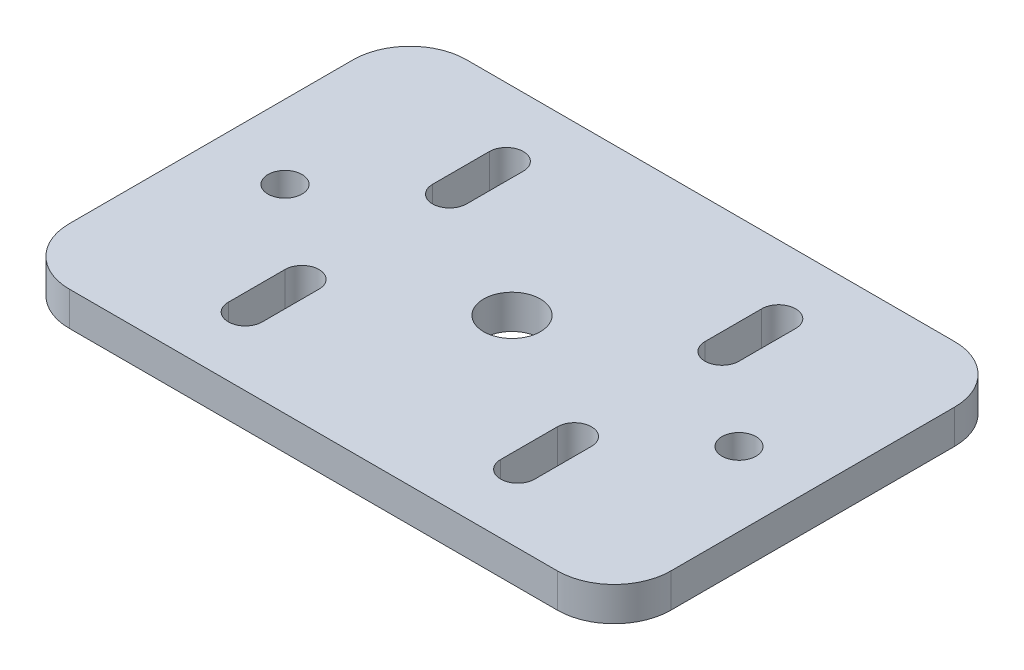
ISO-10303-21;
HEADER;
FILE_DESCRIPTION(('STEP AP214'),'2;1');
FILE_NAME('part.step','',(''),(''),'','','');
FILE_SCHEMA(('AUTOMOTIVE_DESIGN { 1 0 10303 214 1 1 1 1 }'));
ENDSEC;
DATA;
#1=APPLICATION_CONTEXT('core data for automotive mechanical design processes');
#2=APPLICATION_PROTOCOL_DEFINITION('international standard','automotive_design',2000,#1);
#3=PRODUCT_CONTEXT('',#1,'mechanical');
#4=PRODUCT('Part','Part','',(#3));
#5=PRODUCT_RELATED_PRODUCT_CATEGORY('part','',(#4));
#6=PRODUCT_DEFINITION_FORMATION('','',#4);
#7=PRODUCT_DEFINITION_CONTEXT('part definition',#1,'design');
#8=PRODUCT_DEFINITION('design','',#6,#7);
#9=PRODUCT_DEFINITION_SHAPE('','',#8);
#10=(LENGTH_UNIT() NAMED_UNIT(*) SI_UNIT(.MILLI.,.METRE.));
#11=(NAMED_UNIT(*) PLANE_ANGLE_UNIT() SI_UNIT($,.RADIAN.));
#12=(NAMED_UNIT(*) SI_UNIT($,.STERADIAN.) SOLID_ANGLE_UNIT());
#13=UNCERTAINTY_MEASURE_WITH_UNIT(LENGTH_MEASURE(1.E-05),#10,'distance_accuracy_value','');
#14=(GEOMETRIC_REPRESENTATION_CONTEXT(3) GLOBAL_UNCERTAINTY_ASSIGNED_CONTEXT((#13)) GLOBAL_UNIT_ASSIGNED_CONTEXT((#10,
#11,#12)) REPRESENTATION_CONTEXT('',''));
#15=CARTESIAN_POINT('',(0.,0.,0.));
#16=DIRECTION('',(0.,0.,1.));
#17=DIRECTION('',(1.,0.,0.));
#18=AXIS2_PLACEMENT_3D('',#15,#16,#17);
#19=CARTESIAN_POINT('',(0.,6.,-70.));
#20=DIRECTION('',(0.,-1.,0.));
#21=DIRECTION('',(0.,0.,-1.));
#22=AXIS2_PLACEMENT_3D('',#19,#20,#21);
#23=PLANE('',#22);
#24=CARTESIAN_POINT('',(29.,6.,-58.));
#25=DIRECTION('',(0.,1.,0.));
#26=DIRECTION('',(0.,0.,1.));
#27=AXIS2_PLACEMENT_3D('',#24,#25,#26);
#28=CIRCLE('',#27,3.00000000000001);
#29=CARTESIAN_POINT('',(32.,6.,-58.));
#30=VERTEX_POINT('',#29);
#31=CARTESIAN_POINT('',(26.,6.,-58.));
#32=VERTEX_POINT('',#31);
#33=EDGE_CURVE('E234',#30,#32,#28,.T.);
#34=ORIENTED_EDGE('',*,*,#33,.F.);
#35=DIRECTION('',(0.,0.,-1.));
#36=VECTOR('',#35,1.);
#37=CARTESIAN_POINT('',(32.,6.,-58.));
#38=LINE('',#37,#36);
#39=CARTESIAN_POINT('',(32.,6.,-48.));
#40=VERTEX_POINT('',#39);
#41=EDGE_CURVE('E242',#40,#30,#38,.T.);
#42=ORIENTED_EDGE('',*,*,#41,.F.);
#43=CARTESIAN_POINT('',(29.,6.,-48.));
#44=DIRECTION('',(0.,1.,0.));
#45=DIRECTION('',(0.,0.,1.));
#46=AXIS2_PLACEMENT_3D('',#43,#44,#45);
#47=CIRCLE('',#46,3.);
#48=CARTESIAN_POINT('',(26.,6.,-48.));
#49=VERTEX_POINT('',#48);
#50=EDGE_CURVE('E239',#49,#40,#47,.T.);
#51=ORIENTED_EDGE('',*,*,#50,.F.);
#52=DIRECTION('',(0.,0.,1.));
#53=VECTOR('',#52,1.);
#54=CARTESIAN_POINT('',(26.,6.,-58.));
#55=LINE('',#54,#53);
#56=EDGE_CURVE('E236',#32,#49,#55,.T.);
#57=ORIENTED_EDGE('',*,*,#56,.F.);
#58=EDGE_LOOP('',(#34,#42,#51,#57));
#59=FACE_BOUND('',#58,.T.);
#60=CARTESIAN_POINT('',(77.,6.,-58.));
#61=DIRECTION('',(0.,1.,0.));
#62=DIRECTION('',(0.,0.,1.));
#63=AXIS2_PLACEMENT_3D('',#60,#61,#62);
#64=CIRCLE('',#63,3.00000000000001);
#65=CARTESIAN_POINT('',(80.,6.,-58.));
#66=VERTEX_POINT('',#65);
#67=CARTESIAN_POINT('',(74.,6.,-58.));
#68=VERTEX_POINT('',#67);
#69=EDGE_CURVE('E296',#66,#68,#64,.T.);
#70=ORIENTED_EDGE('',*,*,#69,.F.);
#71=DIRECTION('',(0.,0.,-1.));
#72=VECTOR('',#71,1.);
#73=CARTESIAN_POINT('',(80.,6.,-58.));
#74=LINE('',#73,#72);
#75=CARTESIAN_POINT('',(80.,6.,-48.));
#76=VERTEX_POINT('',#75);
#77=EDGE_CURVE('E304',#76,#66,#74,.T.);
#78=ORIENTED_EDGE('',*,*,#77,.F.);
#79=CARTESIAN_POINT('',(77.,6.,-48.));
#80=DIRECTION('',(0.,1.,0.));
#81=DIRECTION('',(0.,0.,1.));
#82=AXIS2_PLACEMENT_3D('',#79,#80,#81);
#83=CIRCLE('',#82,3.);
#84=CARTESIAN_POINT('',(74.,6.,-48.));
#85=VERTEX_POINT('',#84);
#86=EDGE_CURVE('E301',#85,#76,#83,.T.);
#87=ORIENTED_EDGE('',*,*,#86,.F.);
#88=DIRECTION('',(0.,0.,1.));
#89=VECTOR('',#88,1.);
#90=CARTESIAN_POINT('',(74.,6.,-58.));
#91=LINE('',#90,#89);
#92=EDGE_CURVE('E298',#68,#85,#91,.T.);
#93=ORIENTED_EDGE('',*,*,#92,.F.);
#94=EDGE_LOOP('',(#70,#78,#87,#93));
#95=FACE_BOUND('',#94,.T.);
#96=CARTESIAN_POINT('',(13.,6.,-35.));
#97=DIRECTION('',(0.,1.,0.));
#98=DIRECTION('',(0.,0.,1.));
#99=AXIS2_PLACEMENT_3D('',#96,#97,#98);
#100=CIRCLE('',#99,3.);
#101=CARTESIAN_POINT('',(13.,6.,-32.));
#102=VERTEX_POINT('',#101);
#103=EDGE_CURVE('E333',#102,#102,#100,.T.);
#104=ORIENTED_EDGE('',*,*,#103,.F.);
#105=EDGE_LOOP('',(#104));
#106=FACE_BOUND('',#105,.T.);
#107=DIRECTION('',(-1.,0.,0.));
#108=VECTOR('',#107,1.);
#109=CARTESIAN_POINT('',(0.,6.,-70.));
#110=LINE('',#109,#108);
#111=CARTESIAN_POINT('',(96.,6.,-70.));
#112=VERTEX_POINT('',#111);
#113=CARTESIAN_POINT('',(10.,6.,-70.));
#114=VERTEX_POINT('',#113);
#115=EDGE_CURVE('E353',#112,#114,#110,.T.);
#116=ORIENTED_EDGE('',*,*,#115,.T.);
#117=CARTESIAN_POINT('',(10.,6.,-60.));
#118=DIRECTION('',(0.,-1.,0.));
#119=DIRECTION('',(0.,0.,-1.));
#120=AXIS2_PLACEMENT_3D('',#117,#118,#119);
#121=CIRCLE('',#120,10.);
#122=CARTESIAN_POINT('',(0.,6.,-60.));
#123=VERTEX_POINT('',#122);
#124=EDGE_CURVE('E388',#114,#123,#121,.F.);
#125=ORIENTED_EDGE('',*,*,#124,.T.);
#126=DIRECTION('',(0.,0.,1.));
#127=VECTOR('',#126,1.);
#128=CARTESIAN_POINT('',(0.,6.,0.));
#129=LINE('',#128,#127);
#130=CARTESIAN_POINT('',(0.,6.,-10.));
#131=VERTEX_POINT('',#130);
#132=EDGE_CURVE('E345',#123,#131,#129,.T.);
#133=ORIENTED_EDGE('',*,*,#132,.T.);
#134=CARTESIAN_POINT('',(10.,6.,-10.));
#135=DIRECTION('',(0.,-1.,0.));
#136=DIRECTION('',(0.,0.,-1.));
#137=AXIS2_PLACEMENT_3D('',#134,#135,#136);
#138=CIRCLE('',#137,10.);
#139=CARTESIAN_POINT('',(10.,6.,0.));
#140=VERTEX_POINT('',#139);
#141=EDGE_CURVE('E383',#131,#140,#138,.F.);
#142=ORIENTED_EDGE('',*,*,#141,.T.);
#143=DIRECTION('',(1.,0.,0.));
#144=VECTOR('',#143,1.);
#145=CARTESIAN_POINT('',(0.,6.,0.));
#146=LINE('',#145,#144);
#147=CARTESIAN_POINT('',(96.,6.,0.));
#148=VERTEX_POINT('',#147);
#149=EDGE_CURVE('E348',#140,#148,#146,.T.);
#150=ORIENTED_EDGE('',*,*,#149,.T.);
#151=CARTESIAN_POINT('',(96.,6.,-10.));
#152=DIRECTION('',(0.,-1.,0.));
#153=DIRECTION('',(0.,0.,-1.));
#154=AXIS2_PLACEMENT_3D('',#151,#152,#153);
#155=CIRCLE('',#154,10.);
#156=CARTESIAN_POINT('',(106.,6.,-10.));
#157=VERTEX_POINT('',#156);
#158=EDGE_CURVE('E52',#148,#157,#155,.F.);
#159=ORIENTED_EDGE('',*,*,#158,.T.);
#160=DIRECTION('',(0.,0.,-1.));
#161=VECTOR('',#160,1.);
#162=CARTESIAN_POINT('',(106.,6.,0.));
#163=LINE('',#162,#161);
#164=CARTESIAN_POINT('',(106.,6.,-60.));
#165=VERTEX_POINT('',#164);
#166=EDGE_CURVE('E351',#157,#165,#163,.T.);
#167=ORIENTED_EDGE('',*,*,#166,.T.);
#168=CARTESIAN_POINT('',(96.,6.,-60.));
#169=DIRECTION('',(0.,-1.,0.));
#170=DIRECTION('',(0.,0.,-1.));
#171=AXIS2_PLACEMENT_3D('',#168,#169,#170);
#172=CIRCLE('',#171,10.);
#173=EDGE_CURVE('E386',#165,#112,#172,.F.);
#174=ORIENTED_EDGE('',*,*,#173,.T.);
#175=EDGE_LOOP('',(#116,#125,#133,#142,#150,#159,#167,#174));
#176=FACE_BOUND('',#175,.T.);
#177=CARTESIAN_POINT('',(53.,6.,-35.));
#178=DIRECTION('',(0.,1.,0.));
#179=DIRECTION('',(0.,0.,1.));
#180=AXIS2_PLACEMENT_3D('',#177,#178,#179);
#181=CIRCLE('',#180,5.);
#182=CARTESIAN_POINT('',(53.,6.,-30.));
#183=VERTEX_POINT('',#182);
#184=EDGE_CURVE('E339',#183,#183,#181,.T.);
#185=ORIENTED_EDGE('',*,*,#184,.F.);
#186=EDGE_LOOP('',(#185));
#187=FACE_BOUND('',#186,.T.);
#188=CARTESIAN_POINT('',(93.,6.,-35.));
#189=DIRECTION('',(0.,1.,0.));
#190=DIRECTION('',(0.,0.,1.));
#191=AXIS2_PLACEMENT_3D('',#188,#189,#190);
#192=CIRCLE('',#191,3.00000000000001);
#193=CARTESIAN_POINT('',(93.,6.,-32.));
#194=VERTEX_POINT('',#193);
#195=EDGE_CURVE('E327',#194,#194,#192,.T.);
#196=ORIENTED_EDGE('',*,*,#195,.F.);
#197=EDGE_LOOP('',(#196));
#198=FACE_BOUND('',#197,.T.);
#199=CARTESIAN_POINT('',(29.0000000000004,6.,-22.));
#200=DIRECTION('',(0.,1.,0.));
#201=DIRECTION('',(0.,0.,1.));
#202=AXIS2_PLACEMENT_3D('',#199,#200,#201);
#203=CIRCLE('',#202,3.);
#204=CARTESIAN_POINT('',(32.0000000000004,6.,-22.));
#205=VERTEX_POINT('',#204);
#206=CARTESIAN_POINT('',(26.0000000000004,6.,-22.));
#207=VERTEX_POINT('',#206);
#208=EDGE_CURVE('E265',#205,#207,#203,.T.);
#209=ORIENTED_EDGE('',*,*,#208,.F.);
#210=DIRECTION('',(0.,0.,-1.));
#211=VECTOR('',#210,1.);
#212=CARTESIAN_POINT('',(32.0000000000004,6.,-22.));
#213=LINE('',#212,#211);
#214=CARTESIAN_POINT('',(32.0000000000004,6.,-12.));
#215=VERTEX_POINT('',#214);
#216=EDGE_CURVE('E273',#215,#205,#213,.T.);
#217=ORIENTED_EDGE('',*,*,#216,.F.);
#218=CARTESIAN_POINT('',(29.0000000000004,6.,-12.));
#219=DIRECTION('',(0.,1.,0.));
#220=DIRECTION('',(0.,0.,1.));
#221=AXIS2_PLACEMENT_3D('',#218,#219,#220);
#222=CIRCLE('',#221,3.);
#223=CARTESIAN_POINT('',(26.0000000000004,6.,-12.));
#224=VERTEX_POINT('',#223);
#225=EDGE_CURVE('E270',#224,#215,#222,.T.);
#226=ORIENTED_EDGE('',*,*,#225,.F.);
#227=DIRECTION('',(0.,0.,1.));
#228=VECTOR('',#227,1.);
#229=CARTESIAN_POINT('',(26.0000000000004,6.,-22.));
#230=LINE('',#229,#228);
#231=EDGE_CURVE('E267',#207,#224,#230,.T.);
#232=ORIENTED_EDGE('',*,*,#231,.F.);
#233=EDGE_LOOP('',(#209,#217,#226,#232));
#234=FACE_BOUND('',#233,.T.);
#235=CARTESIAN_POINT('',(77.0000000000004,6.,-22.));
#236=DIRECTION('',(0.,1.,0.));
#237=DIRECTION('',(0.,0.,1.));
#238=AXIS2_PLACEMENT_3D('',#235,#236,#237);
#239=CIRCLE('',#238,3.);
#240=CARTESIAN_POINT('',(80.0000000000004,6.,-22.));
#241=VERTEX_POINT('',#240);
#242=CARTESIAN_POINT('',(74.0000000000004,6.,-22.));
#243=VERTEX_POINT('',#242);
#244=EDGE_CURVE('E193',#241,#243,#239,.T.);
#245=ORIENTED_EDGE('',*,*,#244,.F.);
#246=DIRECTION('',(0.,0.,-1.));
#247=VECTOR('',#246,1.);
#248=CARTESIAN_POINT('',(80.0000000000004,6.,-22.));
#249=LINE('',#248,#247);
#250=CARTESIAN_POINT('',(80.0000000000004,6.,-12.));
#251=VERTEX_POINT('',#250);
#252=EDGE_CURVE('E218',#251,#241,#249,.T.);
#253=ORIENTED_EDGE('',*,*,#252,.F.);
#254=CARTESIAN_POINT('',(77.0000000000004,6.,-12.));
#255=DIRECTION('',(0.,1.,0.));
#256=DIRECTION('',(0.,0.,1.));
#257=AXIS2_PLACEMENT_3D('',#254,#255,#256);
#258=CIRCLE('',#257,3.);
#259=CARTESIAN_POINT('',(74.0000000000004,6.,-12.));
#260=VERTEX_POINT('',#259);
#261=EDGE_CURVE('E216',#260,#251,#258,.T.);
#262=ORIENTED_EDGE('',*,*,#261,.F.);
#263=DIRECTION('',(0.,0.,1.));
#264=VECTOR('',#263,1.);
#265=CARTESIAN_POINT('',(74.0000000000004,6.,-22.));
#266=LINE('',#265,#264);
#267=EDGE_CURVE('E203',#243,#260,#266,.T.);
#268=ORIENTED_EDGE('',*,*,#267,.F.);
#269=EDGE_LOOP('',(#245,#253,#262,#268));
#270=FACE_BOUND('',#269,.T.);
#271=ADVANCED_FACE('F30',(#59,#95,#106,#176,#187,#198,#234,#270),#23,.F.);
#272=CARTESIAN_POINT('',(0.,0.,-70.));
#273=DIRECTION('',(0.,-1.,0.));
#274=DIRECTION('',(0.,0.,-1.));
#275=AXIS2_PLACEMENT_3D('',#272,#273,#274);
#276=PLANE('',#275);
#277=DIRECTION('',(0.,0.,-1.));
#278=VECTOR('',#277,1.);
#279=CARTESIAN_POINT('',(32.,0.,-58.));
#280=LINE('',#279,#278);
#281=CARTESIAN_POINT('',(32.,0.,-48.));
#282=VERTEX_POINT('',#281);
#283=CARTESIAN_POINT('',(32.,0.,-58.));
#284=VERTEX_POINT('',#283);
#285=EDGE_CURVE('E237',#282,#284,#280,.T.);
#286=ORIENTED_EDGE('',*,*,#285,.T.);
#287=CARTESIAN_POINT('',(29.,0.,-58.));
#288=DIRECTION('',(0.,1.,0.));
#289=DIRECTION('',(0.,0.,1.));
#290=AXIS2_PLACEMENT_3D('',#287,#288,#289);
#291=CIRCLE('',#290,3.00000000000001);
#292=CARTESIAN_POINT('',(26.,0.,-58.));
#293=VERTEX_POINT('',#292);
#294=EDGE_CURVE('E211',#284,#293,#291,.T.);
#295=ORIENTED_EDGE('',*,*,#294,.T.);
#296=DIRECTION('',(0.,0.,1.));
#297=VECTOR('',#296,1.);
#298=CARTESIAN_POINT('',(26.,0.,-58.));
#299=LINE('',#298,#297);
#300=CARTESIAN_POINT('',(26.,0.,-48.));
#301=VERTEX_POINT('',#300);
#302=EDGE_CURVE('E247',#293,#301,#299,.T.);
#303=ORIENTED_EDGE('',*,*,#302,.T.);
#304=CARTESIAN_POINT('',(29.,0.,-48.));
#305=DIRECTION('',(0.,1.,0.));
#306=DIRECTION('',(0.,0.,1.));
#307=AXIS2_PLACEMENT_3D('',#304,#305,#306);
#308=CIRCLE('',#307,3.);
#309=EDGE_CURVE('E250',#301,#282,#308,.T.);
#310=ORIENTED_EDGE('',*,*,#309,.T.);
#311=EDGE_LOOP('',(#286,#295,#303,#310));
#312=FACE_BOUND('',#311,.T.);
#313=DIRECTION('',(0.,0.,-1.));
#314=VECTOR('',#313,1.);
#315=CARTESIAN_POINT('',(80.,0.,-58.));
#316=LINE('',#315,#314);
#317=CARTESIAN_POINT('',(80.,0.,-48.));
#318=VERTEX_POINT('',#317);
#319=CARTESIAN_POINT('',(80.,0.,-58.));
#320=VERTEX_POINT('',#319);
#321=EDGE_CURVE('E299',#318,#320,#316,.T.);
#322=ORIENTED_EDGE('',*,*,#321,.T.);
#323=CARTESIAN_POINT('',(77.,0.,-58.));
#324=DIRECTION('',(0.,1.,0.));
#325=DIRECTION('',(0.,0.,1.));
#326=AXIS2_PLACEMENT_3D('',#323,#324,#325);
#327=CIRCLE('',#326,3.00000000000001);
#328=CARTESIAN_POINT('',(74.,0.,-58.));
#329=VERTEX_POINT('',#328);
#330=EDGE_CURVE('E295',#320,#329,#327,.T.);
#331=ORIENTED_EDGE('',*,*,#330,.T.);
#332=DIRECTION('',(0.,0.,1.));
#333=VECTOR('',#332,1.);
#334=CARTESIAN_POINT('',(74.,0.,-58.));
#335=LINE('',#334,#333);
#336=CARTESIAN_POINT('',(74.,0.,-48.));
#337=VERTEX_POINT('',#336);
#338=EDGE_CURVE('E309',#329,#337,#335,.T.);
#339=ORIENTED_EDGE('',*,*,#338,.T.);
#340=CARTESIAN_POINT('',(77.,0.,-48.));
#341=DIRECTION('',(0.,1.,0.));
#342=DIRECTION('',(0.,0.,1.));
#343=AXIS2_PLACEMENT_3D('',#340,#341,#342);
#344=CIRCLE('',#343,3.);
#345=EDGE_CURVE('E312',#337,#318,#344,.T.);
#346=ORIENTED_EDGE('',*,*,#345,.T.);
#347=EDGE_LOOP('',(#322,#331,#339,#346));
#348=FACE_BOUND('',#347,.T.);
#349=CARTESIAN_POINT('',(13.,0.,-35.));
#350=DIRECTION('',(0.,1.,0.));
#351=DIRECTION('',(0.,0.,1.));
#352=AXIS2_PLACEMENT_3D('',#349,#350,#351);
#353=CIRCLE('',#352,3.);
#354=CARTESIAN_POINT('',(13.,0.,-32.));
#355=VERTEX_POINT('',#354);
#356=EDGE_CURVE('E330',#355,#355,#353,.T.);
#357=ORIENTED_EDGE('',*,*,#356,.T.);
#358=EDGE_LOOP('',(#357));
#359=FACE_BOUND('',#358,.T.);
#360=DIRECTION('',(0.,0.,1.));
#361=VECTOR('',#360,1.);
#362=CARTESIAN_POINT('',(0.,0.,0.));
#363=LINE('',#362,#361);
#364=CARTESIAN_POINT('',(0.,0.,-60.));
#365=VERTEX_POINT('',#364);
#366=CARTESIAN_POINT('',(0.,0.,-10.));
#367=VERTEX_POINT('',#366);
#368=EDGE_CURVE('E342',#365,#367,#363,.T.);
#369=ORIENTED_EDGE('',*,*,#368,.F.);
#370=CARTESIAN_POINT('',(10.,0.,-60.));
#371=DIRECTION('',(0.,-1.,0.));
#372=DIRECTION('',(0.,0.,-1.));
#373=AXIS2_PLACEMENT_3D('',#370,#371,#372);
#374=CIRCLE('',#373,10.);
#375=CARTESIAN_POINT('',(10.,0.,-70.));
#376=VERTEX_POINT('',#375);
#377=EDGE_CURVE('E376',#365,#376,#374,.T.);
#378=ORIENTED_EDGE('',*,*,#377,.T.);
#379=DIRECTION('',(-1.,0.,0.));
#380=VECTOR('',#379,1.);
#381=CARTESIAN_POINT('',(0.,0.,-70.));
#382=LINE('',#381,#380);
#383=CARTESIAN_POINT('',(96.,0.,-70.));
#384=VERTEX_POINT('',#383);
#385=EDGE_CURVE('E349',#384,#376,#382,.T.);
#386=ORIENTED_EDGE('',*,*,#385,.F.);
#387=CARTESIAN_POINT('',(96.,0.,-60.));
#388=DIRECTION('',(0.,-1.,0.));
#389=DIRECTION('',(0.,0.,-1.));
#390=AXIS2_PLACEMENT_3D('',#387,#388,#389);
#391=CIRCLE('',#390,10.);
#392=CARTESIAN_POINT('',(106.,0.,-60.));
#393=VERTEX_POINT('',#392);
#394=EDGE_CURVE('E374',#384,#393,#391,.T.);
#395=ORIENTED_EDGE('',*,*,#394,.T.);
#396=DIRECTION('',(0.,0.,-1.));
#397=VECTOR('',#396,1.);
#398=CARTESIAN_POINT('',(106.,0.,0.));
#399=LINE('',#398,#397);
#400=CARTESIAN_POINT('',(106.,0.,-10.));
#401=VERTEX_POINT('',#400);
#402=EDGE_CURVE('E362',#401,#393,#399,.T.);
#403=ORIENTED_EDGE('',*,*,#402,.F.);
#404=CARTESIAN_POINT('',(96.,0.,-10.));
#405=DIRECTION('',(0.,-1.,0.));
#406=DIRECTION('',(0.,0.,-1.));
#407=AXIS2_PLACEMENT_3D('',#404,#405,#406);
#408=CIRCLE('',#407,10.);
#409=CARTESIAN_POINT('',(96.,0.,0.));
#410=VERTEX_POINT('',#409);
#411=EDGE_CURVE('E372',#401,#410,#408,.T.);
#412=ORIENTED_EDGE('',*,*,#411,.T.);
#413=DIRECTION('',(1.,0.,0.));
#414=VECTOR('',#413,1.);
#415=CARTESIAN_POINT('',(0.,0.,0.));
#416=LINE('',#415,#414);
#417=CARTESIAN_POINT('',(10.,0.,0.));
#418=VERTEX_POINT('',#417);
#419=EDGE_CURVE('E359',#418,#410,#416,.T.);
#420=ORIENTED_EDGE('',*,*,#419,.F.);
#421=CARTESIAN_POINT('',(10.,0.,-10.));
#422=DIRECTION('',(0.,-1.,0.));
#423=DIRECTION('',(0.,0.,-1.));
#424=AXIS2_PLACEMENT_3D('',#421,#422,#423);
#425=CIRCLE('',#424,10.);
#426=EDGE_CURVE('E370',#418,#367,#425,.T.);
#427=ORIENTED_EDGE('',*,*,#426,.T.);
#428=EDGE_LOOP('',(#369,#378,#386,#395,#403,#412,#420,#427));
#429=FACE_BOUND('',#428,.T.);
#430=CARTESIAN_POINT('',(53.,0.,-35.));
#431=DIRECTION('',(0.,1.,0.));
#432=DIRECTION('',(0.,0.,1.));
#433=AXIS2_PLACEMENT_3D('',#430,#431,#432);
#434=CIRCLE('',#433,5.);
#435=CARTESIAN_POINT('',(53.,0.,-30.));
#436=VERTEX_POINT('',#435);
#437=EDGE_CURVE('E336',#436,#436,#434,.T.);
#438=ORIENTED_EDGE('',*,*,#437,.T.);
#439=EDGE_LOOP('',(#438));
#440=FACE_BOUND('',#439,.T.);
#441=CARTESIAN_POINT('',(93.,0.,-35.));
#442=DIRECTION('',(0.,1.,0.));
#443=DIRECTION('',(0.,0.,1.));
#444=AXIS2_PLACEMENT_3D('',#441,#442,#443);
#445=CIRCLE('',#444,3.00000000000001);
#446=CARTESIAN_POINT('',(93.,0.,-32.));
#447=VERTEX_POINT('',#446);
#448=EDGE_CURVE('E326',#447,#447,#445,.T.);
#449=ORIENTED_EDGE('',*,*,#448,.T.);
#450=EDGE_LOOP('',(#449));
#451=FACE_BOUND('',#450,.T.);
#452=DIRECTION('',(0.,0.,-1.));
#453=VECTOR('',#452,1.);
#454=CARTESIAN_POINT('',(32.0000000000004,0.,-22.));
#455=LINE('',#454,#453);
#456=CARTESIAN_POINT('',(32.0000000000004,0.,-12.));
#457=VERTEX_POINT('',#456);
#458=CARTESIAN_POINT('',(32.0000000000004,0.,-22.));
#459=VERTEX_POINT('',#458);
#460=EDGE_CURVE('E268',#457,#459,#455,.T.);
#461=ORIENTED_EDGE('',*,*,#460,.T.);
#462=CARTESIAN_POINT('',(29.0000000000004,0.,-22.));
#463=DIRECTION('',(0.,1.,0.));
#464=DIRECTION('',(0.,0.,1.));
#465=AXIS2_PLACEMENT_3D('',#462,#463,#464);
#466=CIRCLE('',#465,3.);
#467=CARTESIAN_POINT('',(26.0000000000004,0.,-22.));
#468=VERTEX_POINT('',#467);
#469=EDGE_CURVE('E264',#459,#468,#466,.T.);
#470=ORIENTED_EDGE('',*,*,#469,.T.);
#471=DIRECTION('',(0.,0.,1.));
#472=VECTOR('',#471,1.);
#473=CARTESIAN_POINT('',(26.0000000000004,0.,-22.));
#474=LINE('',#473,#472);
#475=CARTESIAN_POINT('',(26.0000000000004,0.,-12.));
#476=VERTEX_POINT('',#475);
#477=EDGE_CURVE('E278',#468,#476,#474,.T.);
#478=ORIENTED_EDGE('',*,*,#477,.T.);
#479=CARTESIAN_POINT('',(29.0000000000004,0.,-12.));
#480=DIRECTION('',(0.,1.,0.));
#481=DIRECTION('',(0.,0.,1.));
#482=AXIS2_PLACEMENT_3D('',#479,#480,#481);
#483=CIRCLE('',#482,3.);
#484=EDGE_CURVE('E281',#476,#457,#483,.T.);
#485=ORIENTED_EDGE('',*,*,#484,.T.);
#486=EDGE_LOOP('',(#461,#470,#478,#485));
#487=FACE_BOUND('',#486,.T.);
#488=DIRECTION('',(0.,0.,-1.));
#489=VECTOR('',#488,1.);
#490=CARTESIAN_POINT('',(80.0000000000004,0.,-22.));
#491=LINE('',#490,#489);
#492=CARTESIAN_POINT('',(80.0000000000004,0.,-12.));
#493=VERTEX_POINT('',#492);
#494=CARTESIAN_POINT('',(80.0000000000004,0.,-22.));
#495=VERTEX_POINT('',#494);
#496=EDGE_CURVE('E204',#493,#495,#491,.T.);
#497=ORIENTED_EDGE('',*,*,#496,.T.);
#498=CARTESIAN_POINT('',(77.0000000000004,0.,-22.));
#499=DIRECTION('',(0.,1.,0.));
#500=DIRECTION('',(0.,0.,1.));
#501=AXIS2_PLACEMENT_3D('',#498,#499,#500);
#502=CIRCLE('',#501,3.);
#503=CARTESIAN_POINT('',(74.0000000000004,0.,-22.));
#504=VERTEX_POINT('',#503);
#505=EDGE_CURVE('E222',#495,#504,#502,.T.);
#506=ORIENTED_EDGE('',*,*,#505,.T.);
#507=DIRECTION('',(0.,0.,1.));
#508=VECTOR('',#507,1.);
#509=CARTESIAN_POINT('',(74.0000000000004,0.,-22.));
#510=LINE('',#509,#508);
#511=CARTESIAN_POINT('',(74.0000000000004,0.,-12.));
#512=VERTEX_POINT('',#511);
#513=EDGE_CURVE('E210',#504,#512,#510,.T.);
#514=ORIENTED_EDGE('',*,*,#513,.T.);
#515=CARTESIAN_POINT('',(77.0000000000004,0.,-12.));
#516=DIRECTION('',(0.,1.,0.));
#517=DIRECTION('',(0.,0.,1.));
#518=AXIS2_PLACEMENT_3D('',#515,#516,#517);
#519=CIRCLE('',#518,3.);
#520=EDGE_CURVE('E225',#512,#493,#519,.T.);
#521=ORIENTED_EDGE('',*,*,#520,.T.);
#522=EDGE_LOOP('',(#497,#506,#514,#521));
#523=FACE_BOUND('',#522,.T.);
#524=ADVANCED_FACE('F404',(#312,#348,#359,#429,#440,#451,#487,#523),#276,.T.);
#525=CARTESIAN_POINT('',(0.,6.,0.));
#526=DIRECTION('',(1.,0.,0.));
#527=DIRECTION('',(0.,0.,-1.));
#528=AXIS2_PLACEMENT_3D('',#525,#526,#527);
#529=PLANE('',#528);
#530=ORIENTED_EDGE('',*,*,#132,.F.);
#531=DIRECTION('',(0.,-1.,0.));
#532=VECTOR('',#531,1.);
#533=CARTESIAN_POINT('',(0.,6.,-60.));
#534=LINE('',#533,#532);
#535=EDGE_CURVE('E367',#123,#365,#534,.T.);
#536=ORIENTED_EDGE('',*,*,#535,.T.);
#537=ORIENTED_EDGE('',*,*,#368,.T.);
#538=DIRECTION('',(0.,-1.,0.));
#539=VECTOR('',#538,1.);
#540=CARTESIAN_POINT('',(0.,6.,-10.));
#541=LINE('',#540,#539);
#542=EDGE_CURVE('E356',#367,#131,#541,.F.);
#543=ORIENTED_EDGE('',*,*,#542,.T.);
#544=EDGE_LOOP('',(#530,#536,#537,#543));
#545=FACE_BOUND('',#544,.T.);
#546=ADVANCED_FACE('F427',(#545),#529,.F.);
#547=CARTESIAN_POINT('',(0.,6.,0.));
#548=DIRECTION('',(0.,0.,-1.));
#549=DIRECTION('',(-1.,0.,0.));
#550=AXIS2_PLACEMENT_3D('',#547,#548,#549);
#551=PLANE('',#550);
#552=ORIENTED_EDGE('',*,*,#419,.T.);
#553=DIRECTION('',(0.,-1.,0.));
#554=VECTOR('',#553,1.);
#555=CARTESIAN_POINT('',(96.,6.,0.));
#556=LINE('',#555,#554);
#557=EDGE_CURVE('E11',#410,#148,#556,.F.);
#558=ORIENTED_EDGE('',*,*,#557,.T.);
#559=ORIENTED_EDGE('',*,*,#149,.F.);
#560=DIRECTION('',(0.,-1.,0.));
#561=VECTOR('',#560,1.);
#562=CARTESIAN_POINT('',(10.,6.,0.));
#563=LINE('',#562,#561);
#564=EDGE_CURVE('E38',#140,#418,#563,.T.);
#565=ORIENTED_EDGE('',*,*,#564,.T.);
#566=EDGE_LOOP('',(#552,#558,#559,#565));
#567=FACE_BOUND('',#566,.T.);
#568=ADVANCED_FACE('F398',(#567),#551,.F.);
#569=CARTESIAN_POINT('',(106.,6.,0.));
#570=DIRECTION('',(-1.,0.,0.));
#571=DIRECTION('',(0.,0.,1.));
#572=AXIS2_PLACEMENT_3D('',#569,#570,#571);
#573=PLANE('',#572);
#574=ORIENTED_EDGE('',*,*,#402,.T.);
#575=DIRECTION('',(0.,-1.,0.));
#576=VECTOR('',#575,1.);
#577=CARTESIAN_POINT('',(106.,6.,-60.));
#578=LINE('',#577,#576);
#579=EDGE_CURVE('E45',#393,#165,#578,.F.);
#580=ORIENTED_EDGE('',*,*,#579,.T.);
#581=ORIENTED_EDGE('',*,*,#166,.F.);
#582=DIRECTION('',(0.,-1.,0.));
#583=VECTOR('',#582,1.);
#584=CARTESIAN_POINT('',(106.,6.,-10.));
#585=LINE('',#584,#583);
#586=EDGE_CURVE('E390',#157,#401,#585,.T.);
#587=ORIENTED_EDGE('',*,*,#586,.T.);
#588=EDGE_LOOP('',(#574,#580,#581,#587));
#589=FACE_BOUND('',#588,.T.);
#590=ADVANCED_FACE('F410',(#589),#573,.F.);
#591=CARTESIAN_POINT('',(0.,6.,-70.));
#592=DIRECTION('',(0.,0.,1.));
#593=DIRECTION('',(1.,0.,0.));
#594=AXIS2_PLACEMENT_3D('',#591,#592,#593);
#595=PLANE('',#594);
#596=ORIENTED_EDGE('',*,*,#385,.T.);
#597=DIRECTION('',(0.,-1.,0.));
#598=VECTOR('',#597,1.);
#599=CARTESIAN_POINT('',(10.,6.,-70.));
#600=LINE('',#599,#598);
#601=EDGE_CURVE('E381',#376,#114,#600,.F.);
#602=ORIENTED_EDGE('',*,*,#601,.T.);
#603=ORIENTED_EDGE('',*,*,#115,.F.);
#604=DIRECTION('',(0.,-1.,0.));
#605=VECTOR('',#604,1.);
#606=CARTESIAN_POINT('',(96.,6.,-70.));
#607=LINE('',#606,#605);
#608=EDGE_CURVE('E378',#112,#384,#607,.T.);
#609=ORIENTED_EDGE('',*,*,#608,.T.);
#610=EDGE_LOOP('',(#596,#602,#603,#609));
#611=FACE_BOUND('',#610,.T.);
#612=ADVANCED_FACE('F419',(#611),#595,.F.);
#613=CARTESIAN_POINT('',(53.,6.,-35.));
#614=DIRECTION('',(0.,-1.,0.));
#615=DIRECTION('',(0.,0.,-1.));
#616=AXIS2_PLACEMENT_3D('',#613,#614,#615);
#617=CYLINDRICAL_SURFACE('',#616,5.);
#618=ORIENTED_EDGE('',*,*,#184,.T.);
#619=EDGE_LOOP('',(#618));
#620=FACE_BOUND('',#619,.T.);
#621=ORIENTED_EDGE('',*,*,#437,.F.);
#622=EDGE_LOOP('',(#621));
#623=FACE_BOUND('',#622,.T.);
#624=ADVANCED_FACE('F444',(#620,#623),#617,.F.);
#625=CARTESIAN_POINT('',(13.,6.,-35.));
#626=DIRECTION('',(0.,-1.,0.));
#627=DIRECTION('',(0.,0.,-1.));
#628=AXIS2_PLACEMENT_3D('',#625,#626,#627);
#629=CYLINDRICAL_SURFACE('',#628,3.);
#630=ORIENTED_EDGE('',*,*,#103,.T.);
#631=EDGE_LOOP('',(#630));
#632=FACE_BOUND('',#631,.T.);
#633=ORIENTED_EDGE('',*,*,#356,.F.);
#634=EDGE_LOOP('',(#633));
#635=FACE_BOUND('',#634,.T.);
#636=ADVANCED_FACE('F628',(#632,#635),#629,.F.);
#637=CARTESIAN_POINT('',(93.,6.,-35.));
#638=DIRECTION('',(0.,-1.,0.));
#639=DIRECTION('',(0.,0.,-1.));
#640=AXIS2_PLACEMENT_3D('',#637,#638,#639);
#641=CYLINDRICAL_SURFACE('',#640,3.00000000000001);
#642=ORIENTED_EDGE('',*,*,#195,.T.);
#643=EDGE_LOOP('',(#642));
#644=FACE_BOUND('',#643,.T.);
#645=ORIENTED_EDGE('',*,*,#448,.F.);
#646=EDGE_LOOP('',(#645));
#647=FACE_BOUND('',#646,.T.);
#648=ADVANCED_FACE('F619',(#644,#647),#641,.F.);
#649=CARTESIAN_POINT('',(77.,6.,-58.));
#650=DIRECTION('',(0.,-1.,0.));
#651=DIRECTION('',(0.,0.,-1.));
#652=AXIS2_PLACEMENT_3D('',#649,#650,#651);
#653=CYLINDRICAL_SURFACE('',#652,3.00000000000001);
#654=ORIENTED_EDGE('',*,*,#330,.F.);
#655=DIRECTION('',(0.,-1.,0.));
#656=VECTOR('',#655,1.);
#657=CARTESIAN_POINT('',(80.,6.,-58.));
#658=LINE('',#657,#656);
#659=EDGE_CURVE('E306',#66,#320,#658,.T.);
#660=ORIENTED_EDGE('',*,*,#659,.F.);
#661=ORIENTED_EDGE('',*,*,#69,.T.);
#662=DIRECTION('',(0.,-1.,0.));
#663=VECTOR('',#662,1.);
#664=CARTESIAN_POINT('',(74.,6.,-58.));
#665=LINE('',#664,#663);
#666=EDGE_CURVE('E323',#68,#329,#665,.T.);
#667=ORIENTED_EDGE('',*,*,#666,.T.);
#668=EDGE_LOOP('',(#654,#660,#661,#667));
#669=FACE_BOUND('',#668,.T.);
#670=ADVANCED_FACE('F610',(#669),#653,.F.);
#671=CARTESIAN_POINT('',(74.,6.,-58.));
#672=DIRECTION('',(1.,0.,0.));
#673=DIRECTION('',(0.,0.,-1.));
#674=AXIS2_PLACEMENT_3D('',#671,#672,#673);
#675=PLANE('',#674);
#676=ORIENTED_EDGE('',*,*,#338,.F.);
#677=ORIENTED_EDGE('',*,*,#666,.F.);
#678=ORIENTED_EDGE('',*,*,#92,.T.);
#679=DIRECTION('',(0.,-1.,0.));
#680=VECTOR('',#679,1.);
#681=CARTESIAN_POINT('',(74.,6.,-48.));
#682=LINE('',#681,#680);
#683=EDGE_CURVE('E321',#85,#337,#682,.T.);
#684=ORIENTED_EDGE('',*,*,#683,.T.);
#685=EDGE_LOOP('',(#676,#677,#678,#684));
#686=FACE_BOUND('',#685,.T.);
#687=ADVANCED_FACE('F601',(#686),#675,.T.);
#688=CARTESIAN_POINT('',(77.,6.,-48.));
#689=DIRECTION('',(0.,-1.,0.));
#690=DIRECTION('',(0.,0.,-1.));
#691=AXIS2_PLACEMENT_3D('',#688,#689,#690);
#692=CYLINDRICAL_SURFACE('',#691,3.);
#693=ORIENTED_EDGE('',*,*,#345,.F.);
#694=ORIENTED_EDGE('',*,*,#683,.F.);
#695=ORIENTED_EDGE('',*,*,#86,.T.);
#696=DIRECTION('',(0.,-1.,0.));
#697=VECTOR('',#696,1.);
#698=CARTESIAN_POINT('',(80.,6.,-48.));
#699=LINE('',#698,#697);
#700=EDGE_CURVE('E319',#76,#318,#699,.T.);
#701=ORIENTED_EDGE('',*,*,#700,.T.);
#702=EDGE_LOOP('',(#693,#694,#695,#701));
#703=FACE_BOUND('',#702,.T.);
#704=ADVANCED_FACE('F592',(#703),#692,.F.);
#705=CARTESIAN_POINT('',(80.,6.,-58.));
#706=DIRECTION('',(-1.,0.,0.));
#707=DIRECTION('',(0.,0.,1.));
#708=AXIS2_PLACEMENT_3D('',#705,#706,#707);
#709=PLANE('',#708);
#710=ORIENTED_EDGE('',*,*,#321,.F.);
#711=ORIENTED_EDGE('',*,*,#700,.F.);
#712=ORIENTED_EDGE('',*,*,#77,.T.);
#713=ORIENTED_EDGE('',*,*,#659,.T.);
#714=EDGE_LOOP('',(#710,#711,#712,#713));
#715=FACE_BOUND('',#714,.T.);
#716=ADVANCED_FACE('F583',(#715),#709,.T.);
#717=CARTESIAN_POINT('',(29.0000000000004,6.,-22.));
#718=DIRECTION('',(0.,-1.,0.));
#719=DIRECTION('',(0.,0.,-1.));
#720=AXIS2_PLACEMENT_3D('',#717,#718,#719);
#721=CYLINDRICAL_SURFACE('',#720,3.);
#722=ORIENTED_EDGE('',*,*,#469,.F.);
#723=DIRECTION('',(0.,-1.,0.));
#724=VECTOR('',#723,1.);
#725=CARTESIAN_POINT('',(32.0000000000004,6.,-22.));
#726=LINE('',#725,#724);
#727=EDGE_CURVE('E275',#205,#459,#726,.T.);
#728=ORIENTED_EDGE('',*,*,#727,.F.);
#729=ORIENTED_EDGE('',*,*,#208,.T.);
#730=DIRECTION('',(0.,-1.,0.));
#731=VECTOR('',#730,1.);
#732=CARTESIAN_POINT('',(26.0000000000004,6.,-22.));
#733=LINE('',#732,#731);
#734=EDGE_CURVE('E292',#207,#468,#733,.T.);
#735=ORIENTED_EDGE('',*,*,#734,.T.);
#736=EDGE_LOOP('',(#722,#728,#729,#735));
#737=FACE_BOUND('',#736,.T.);
#738=ADVANCED_FACE('F574',(#737),#721,.F.);
#739=CARTESIAN_POINT('',(26.0000000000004,6.,-22.));
#740=DIRECTION('',(1.,0.,0.));
#741=DIRECTION('',(0.,0.,-1.));
#742=AXIS2_PLACEMENT_3D('',#739,#740,#741);
#743=PLANE('',#742);
#744=ORIENTED_EDGE('',*,*,#477,.F.);
#745=ORIENTED_EDGE('',*,*,#734,.F.);
#746=ORIENTED_EDGE('',*,*,#231,.T.);
#747=DIRECTION('',(0.,-1.,0.));
#748=VECTOR('',#747,1.);
#749=CARTESIAN_POINT('',(26.0000000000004,6.,-12.));
#750=LINE('',#749,#748);
#751=EDGE_CURVE('E290',#224,#476,#750,.T.);
#752=ORIENTED_EDGE('',*,*,#751,.T.);
#753=EDGE_LOOP('',(#744,#745,#746,#752));
#754=FACE_BOUND('',#753,.T.);
#755=ADVANCED_FACE('F565',(#754),#743,.T.);
#756=CARTESIAN_POINT('',(29.0000000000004,6.,-12.));
#757=DIRECTION('',(0.,-1.,0.));
#758=DIRECTION('',(0.,0.,-1.));
#759=AXIS2_PLACEMENT_3D('',#756,#757,#758);
#760=CYLINDRICAL_SURFACE('',#759,3.);
#761=ORIENTED_EDGE('',*,*,#484,.F.);
#762=ORIENTED_EDGE('',*,*,#751,.F.);
#763=ORIENTED_EDGE('',*,*,#225,.T.);
#764=DIRECTION('',(0.,-1.,0.));
#765=VECTOR('',#764,1.);
#766=CARTESIAN_POINT('',(32.0000000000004,6.,-12.));
#767=LINE('',#766,#765);
#768=EDGE_CURVE('E288',#215,#457,#767,.T.);
#769=ORIENTED_EDGE('',*,*,#768,.T.);
#770=EDGE_LOOP('',(#761,#762,#763,#769));
#771=FACE_BOUND('',#770,.T.);
#772=ADVANCED_FACE('F556',(#771),#760,.F.);
#773=CARTESIAN_POINT('',(32.0000000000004,6.,-22.));
#774=DIRECTION('',(-1.,0.,0.));
#775=DIRECTION('',(0.,0.,1.));
#776=AXIS2_PLACEMENT_3D('',#773,#774,#775);
#777=PLANE('',#776);
#778=ORIENTED_EDGE('',*,*,#460,.F.);
#779=ORIENTED_EDGE('',*,*,#768,.F.);
#780=ORIENTED_EDGE('',*,*,#216,.T.);
#781=ORIENTED_EDGE('',*,*,#727,.T.);
#782=EDGE_LOOP('',(#778,#779,#780,#781));
#783=FACE_BOUND('',#782,.T.);
#784=ADVANCED_FACE('F547',(#783),#777,.T.);
#785=CARTESIAN_POINT('',(29.,6.,-58.));
#786=DIRECTION('',(0.,-1.,0.));
#787=DIRECTION('',(0.,0.,-1.));
#788=AXIS2_PLACEMENT_3D('',#785,#786,#787);
#789=CYLINDRICAL_SURFACE('',#788,3.00000000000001);
#790=ORIENTED_EDGE('',*,*,#294,.F.);
#791=DIRECTION('',(0.,-1.,0.));
#792=VECTOR('',#791,1.);
#793=CARTESIAN_POINT('',(32.,6.,-58.));
#794=LINE('',#793,#792);
#795=EDGE_CURVE('E244',#30,#284,#794,.T.);
#796=ORIENTED_EDGE('',*,*,#795,.F.);
#797=ORIENTED_EDGE('',*,*,#33,.T.);
#798=DIRECTION('',(0.,-1.,0.));
#799=VECTOR('',#798,1.);
#800=CARTESIAN_POINT('',(26.,6.,-58.));
#801=LINE('',#800,#799);
#802=EDGE_CURVE('E261',#32,#293,#801,.T.);
#803=ORIENTED_EDGE('',*,*,#802,.T.);
#804=EDGE_LOOP('',(#790,#796,#797,#803));
#805=FACE_BOUND('',#804,.T.);
#806=ADVANCED_FACE('F538',(#805),#789,.F.);
#807=CARTESIAN_POINT('',(26.,6.,-58.));
#808=DIRECTION('',(1.,0.,0.));
#809=DIRECTION('',(0.,0.,-1.));
#810=AXIS2_PLACEMENT_3D('',#807,#808,#809);
#811=PLANE('',#810);
#812=ORIENTED_EDGE('',*,*,#302,.F.);
#813=ORIENTED_EDGE('',*,*,#802,.F.);
#814=ORIENTED_EDGE('',*,*,#56,.T.);
#815=DIRECTION('',(0.,-1.,0.));
#816=VECTOR('',#815,1.);
#817=CARTESIAN_POINT('',(26.,6.,-48.));
#818=LINE('',#817,#816);
#819=EDGE_CURVE('E259',#49,#301,#818,.T.);
#820=ORIENTED_EDGE('',*,*,#819,.T.);
#821=EDGE_LOOP('',(#812,#813,#814,#820));
#822=FACE_BOUND('',#821,.T.);
#823=ADVANCED_FACE('F529',(#822),#811,.T.);
#824=CARTESIAN_POINT('',(29.,6.,-48.));
#825=DIRECTION('',(0.,-1.,0.));
#826=DIRECTION('',(0.,0.,-1.));
#827=AXIS2_PLACEMENT_3D('',#824,#825,#826);
#828=CYLINDRICAL_SURFACE('',#827,3.);
#829=ORIENTED_EDGE('',*,*,#309,.F.);
#830=ORIENTED_EDGE('',*,*,#819,.F.);
#831=ORIENTED_EDGE('',*,*,#50,.T.);
#832=DIRECTION('',(0.,-1.,0.));
#833=VECTOR('',#832,1.);
#834=CARTESIAN_POINT('',(32.,6.,-48.));
#835=LINE('',#834,#833);
#836=EDGE_CURVE('E257',#40,#282,#835,.T.);
#837=ORIENTED_EDGE('',*,*,#836,.T.);
#838=EDGE_LOOP('',(#829,#830,#831,#837));
#839=FACE_BOUND('',#838,.T.);
#840=ADVANCED_FACE('F520',(#839),#828,.F.);
#841=CARTESIAN_POINT('',(32.,6.,-58.));
#842=DIRECTION('',(-1.,0.,0.));
#843=DIRECTION('',(0.,0.,1.));
#844=AXIS2_PLACEMENT_3D('',#841,#842,#843);
#845=PLANE('',#844);
#846=ORIENTED_EDGE('',*,*,#285,.F.);
#847=ORIENTED_EDGE('',*,*,#836,.F.);
#848=ORIENTED_EDGE('',*,*,#41,.T.);
#849=ORIENTED_EDGE('',*,*,#795,.T.);
#850=EDGE_LOOP('',(#846,#847,#848,#849));
#851=FACE_BOUND('',#850,.T.);
#852=ADVANCED_FACE('F512',(#851),#845,.T.);
#853=CARTESIAN_POINT('',(77.0000000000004,6.,-22.));
#854=DIRECTION('',(0.,-1.,0.));
#855=DIRECTION('',(0.,0.,-1.));
#856=AXIS2_PLACEMENT_3D('',#853,#854,#855);
#857=CYLINDRICAL_SURFACE('',#856,3.);
#858=ORIENTED_EDGE('',*,*,#505,.F.);
#859=DIRECTION('',(0.,-1.,0.));
#860=VECTOR('',#859,1.);
#861=CARTESIAN_POINT('',(80.0000000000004,6.,-22.));
#862=LINE('',#861,#860);
#863=EDGE_CURVE('E199',#241,#495,#862,.T.);
#864=ORIENTED_EDGE('',*,*,#863,.F.);
#865=ORIENTED_EDGE('',*,*,#244,.T.);
#866=DIRECTION('',(0.,-1.,0.));
#867=VECTOR('',#866,1.);
#868=CARTESIAN_POINT('',(74.0000000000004,6.,-22.));
#869=LINE('',#868,#867);
#870=EDGE_CURVE('E196',#243,#504,#869,.T.);
#871=ORIENTED_EDGE('',*,*,#870,.T.);
#872=EDGE_LOOP('',(#858,#864,#865,#871));
#873=FACE_BOUND('',#872,.T.);
#874=ADVANCED_FACE('F195',(#873),#857,.F.);
#875=CARTESIAN_POINT('',(74.0000000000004,6.,-22.));
#876=DIRECTION('',(1.,0.,0.));
#877=DIRECTION('',(0.,0.,-1.));
#878=AXIS2_PLACEMENT_3D('',#875,#876,#877);
#879=PLANE('',#878);
#880=ORIENTED_EDGE('',*,*,#513,.F.);
#881=ORIENTED_EDGE('',*,*,#870,.F.);
#882=ORIENTED_EDGE('',*,*,#267,.T.);
#883=DIRECTION('',(0.,-1.,0.));
#884=VECTOR('',#883,1.);
#885=CARTESIAN_POINT('',(74.0000000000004,6.,-12.));
#886=LINE('',#885,#884);
#887=EDGE_CURVE('E212',#260,#512,#886,.T.);
#888=ORIENTED_EDGE('',*,*,#887,.T.);
#889=EDGE_LOOP('',(#880,#881,#882,#888));
#890=FACE_BOUND('',#889,.T.);
#891=ADVANCED_FACE('F207',(#890),#879,.T.);
#892=CARTESIAN_POINT('',(77.0000000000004,6.,-12.));
#893=DIRECTION('',(0.,-1.,0.));
#894=DIRECTION('',(0.,0.,-1.));
#895=AXIS2_PLACEMENT_3D('',#892,#893,#894);
#896=CYLINDRICAL_SURFACE('',#895,3.);
#897=ORIENTED_EDGE('',*,*,#520,.F.);
#898=ORIENTED_EDGE('',*,*,#887,.F.);
#899=ORIENTED_EDGE('',*,*,#261,.T.);
#900=DIRECTION('',(0.,-1.,0.));
#901=VECTOR('',#900,1.);
#902=CARTESIAN_POINT('',(80.0000000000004,6.,-12.));
#903=LINE('',#902,#901);
#904=EDGE_CURVE('E231',#251,#493,#903,.T.);
#905=ORIENTED_EDGE('',*,*,#904,.T.);
#906=EDGE_LOOP('',(#897,#898,#899,#905));
#907=FACE_BOUND('',#906,.T.);
#908=ADVANCED_FACE('F488',(#907),#896,.F.);
#909=CARTESIAN_POINT('',(80.0000000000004,6.,-22.));
#910=DIRECTION('',(-1.,0.,0.));
#911=DIRECTION('',(0.,0.,1.));
#912=AXIS2_PLACEMENT_3D('',#909,#910,#911);
#913=PLANE('',#912);
#914=ORIENTED_EDGE('',*,*,#496,.F.);
#915=ORIENTED_EDGE('',*,*,#904,.F.);
#916=ORIENTED_EDGE('',*,*,#252,.T.);
#917=ORIENTED_EDGE('',*,*,#863,.T.);
#918=EDGE_LOOP('',(#914,#915,#916,#917));
#919=FACE_BOUND('',#918,.T.);
#920=ADVANCED_FACE('F457',(#919),#913,.T.);
#921=CARTESIAN_POINT('',(10.,6.,-60.));
#922=DIRECTION('',(0.,-1.,0.));
#923=DIRECTION('',(0.,0.,-1.));
#924=AXIS2_PLACEMENT_3D('',#921,#922,#923);
#925=CYLINDRICAL_SURFACE('',#924,10.);
#926=ORIENTED_EDGE('',*,*,#124,.F.);
#927=ORIENTED_EDGE('',*,*,#601,.F.);
#928=ORIENTED_EDGE('',*,*,#377,.F.);
#929=ORIENTED_EDGE('',*,*,#535,.F.);
#930=EDGE_LOOP('',(#926,#927,#928,#929));
#931=FACE_BOUND('',#930,.T.);
#932=ADVANCED_FACE('F424',(#931),#925,.T.);
#933=CARTESIAN_POINT('',(96.,6.,-60.));
#934=DIRECTION('',(0.,-1.,0.));
#935=DIRECTION('',(0.,0.,-1.));
#936=AXIS2_PLACEMENT_3D('',#933,#934,#935);
#937=CYLINDRICAL_SURFACE('',#936,10.);
#938=ORIENTED_EDGE('',*,*,#173,.F.);
#939=ORIENTED_EDGE('',*,*,#579,.F.);
#940=ORIENTED_EDGE('',*,*,#394,.F.);
#941=ORIENTED_EDGE('',*,*,#608,.F.);
#942=EDGE_LOOP('',(#938,#939,#940,#941));
#943=FACE_BOUND('',#942,.T.);
#944=ADVANCED_FACE('F416',(#943),#937,.T.);
#945=CARTESIAN_POINT('',(96.,6.,-10.));
#946=DIRECTION('',(0.,-1.,0.));
#947=DIRECTION('',(0.,0.,-1.));
#948=AXIS2_PLACEMENT_3D('',#945,#946,#947);
#949=CYLINDRICAL_SURFACE('',#948,10.);
#950=ORIENTED_EDGE('',*,*,#158,.F.);
#951=ORIENTED_EDGE('',*,*,#557,.F.);
#952=ORIENTED_EDGE('',*,*,#411,.F.);
#953=ORIENTED_EDGE('',*,*,#586,.F.);
#954=EDGE_LOOP('',(#950,#951,#952,#953));
#955=FACE_BOUND('',#954,.T.);
#956=ADVANCED_FACE('F409',(#955),#949,.T.);
#957=CARTESIAN_POINT('',(10.,6.,-10.));
#958=DIRECTION('',(0.,-1.,0.));
#959=DIRECTION('',(0.,0.,-1.));
#960=AXIS2_PLACEMENT_3D('',#957,#958,#959);
#961=CYLINDRICAL_SURFACE('',#960,10.);
#962=ORIENTED_EDGE('',*,*,#141,.F.);
#963=ORIENTED_EDGE('',*,*,#542,.F.);
#964=ORIENTED_EDGE('',*,*,#426,.F.);
#965=ORIENTED_EDGE('',*,*,#564,.F.);
#966=EDGE_LOOP('',(#962,#963,#964,#965));
#967=FACE_BOUND('',#966,.T.);
#968=ADVANCED_FACE('F32',(#967),#961,.T.);
#969=CLOSED_SHELL('',(#271,#524,#546,#568,#590,#612,#624,#636,#648,#670,#687,#704,#716,#738,
#755,#772,#784,#806,#823,#840,#852,#874,#891,#908,#920,#932,#944,#956,#968));
#970=MANIFOLD_SOLID_BREP('B2',#969);
#971=ADVANCED_BREP_SHAPE_REPRESENTATION('',(#18,#970),#14);
#972=SHAPE_DEFINITION_REPRESENTATION(#9,#971);
ENDSEC;
END-ISO-10303-21;
